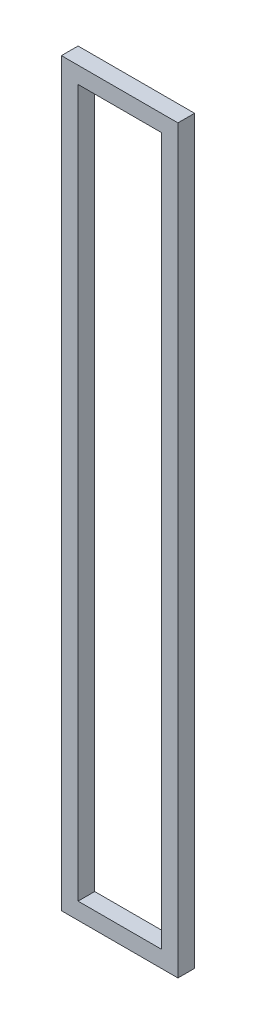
from build123d import *

# Parameters (mm, degrees)
SKETCH1_W      = 17.78
SKETCH1_H      = 113.03
SKETCH1_W_2    = 12.7
SKETCH1_H_2    = 107.95
EXTRUDE1_DEPTH = 2.54


with BuildPart() as part:
    # Sketch1 → Extrude1 (new body)
    with BuildSketch(Plane.XY):
        with Locations((6.35, 53.975)):
            Rectangle(SKETCH1_W, SKETCH1_H)
        with Locations((6.35, 53.975)):
            Rectangle(SKETCH1_W_2, SKETCH1_H_2, mode=Mode.SUBTRACT)
    extrude(amount=EXTRUDE1_DEPTH)


solid = part.part
